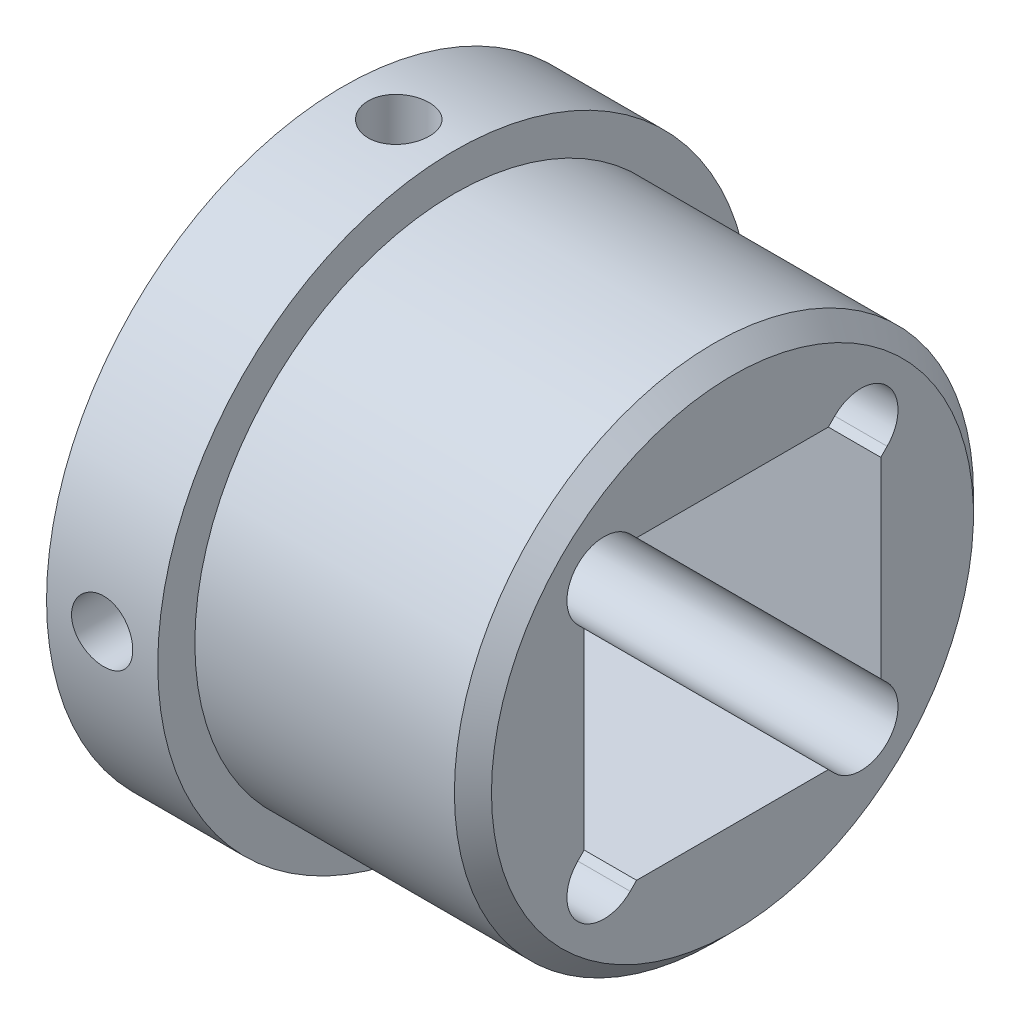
from build123d import *

# Parameters (mm, degrees)
ESQUISSE2_W                  = 16
ESQUISSE2_H                  = 16
ENL_V_MAT_EXTRU_1_DEPTH      = 31.870698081
CHANFREIN1_SIZE              = 1
R_P_TITION_CIRCULAIRE1_COUNT = 4
ENL_V_MAT_EXTRU_2_DEPTH      = 31.870698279
R_P_TITION_CIRCULAIRE2_COUNT = 4


with BuildPart() as part:
    # Esquisse1 → R_volution1 (revolve)
    with BuildSketch(Plane.XY, mode=Mode.PRIVATE) as r_volution1_sk:
        Polygon((0, 0), (21, 0), (21, 14), (6, 14), (6, 16), (0, 16), align=None)
    revolve(r_volution1_sk.sketch.rotate(Axis((-19.097215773, 0, 0), (1, 0, 0)), 90), axis=Axis((-19.097215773, 0, 0), (1, 0, 0)))

    # Esquisse2 → Enl_v. mat.-Extru.1 (cut, through all)
    with BuildSketch(Plane(origin=(21, 0, 0), x_dir=(0, 0, -1), z_dir=(1, 0, 0))):
        Rectangle(ESQUISSE2_W, ESQUISSE2_H)
    extrude(amount=-ENL_V_MAT_EXTRU_1_DEPTH, mode=Mode.SUBTRACT)

    # Chanfrein1
    chanfrein1_edges = [part.edges().sort_by_distance(p)[0] for p in [
        (21, 0, -14),
    ]]
    chamfer(chanfrein1_edges, length=CHANFREIN1_SIZE)

    # Esquisse4 → Trou taraud_ M41 (revolve, cut)
    with BuildSketch(Plane(origin=(3, 8, 0), x_dir=(0, 0, -1), z_dir=(1, 0, 0))):
        Polygon((0, 0), (0, 12.491420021), (1.65, 11.5), (1.65, 0), align=None)
    trou_taraud_m41 = revolve(axis=Axis((3, 1.65, 0), (0, 1, 0)), mode=Mode.SUBTRACT)

    # R_p_tition circulaire1: Trou taraud_ M41 ×4 about axis
    r_p_tition_circulaire1_axis = Axis((-19.097215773, 0, 0), (-1, 0, 0))
    for i in range(1, R_P_TITION_CIRCULAIRE1_COUNT):
        add(trou_taraud_m41.rotate(r_p_tition_circulaire1_axis, i * 360 / R_P_TITION_CIRCULAIRE1_COUNT), mode=Mode.SUBTRACT)

    # Esquisse6 → Enl_v. mat.-Extru.2 (cut, through all)
    with BuildSketch(Plane(origin=(21, 0, 0), x_dir=(0, 0, -1), z_dir=(1, 0, 0))):
        with BuildLine():
            Line((5.515432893, 8.343860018), (5.171572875, 8))
            Line((5.171572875, 8), (8, 5.171572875))
            Line((8, 5.171572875), (8.343860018, 5.515432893))
            ThreePointArc((8.343860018, 5.515432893), (8.343860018, 8.343860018), (5.515432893, 8.343860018))
        make_face()
    enl_v_mat_extru_2 = extrude(amount=-ENL_V_MAT_EXTRU_2_DEPTH, mode=Mode.SUBTRACT)

    # R_p_tition circulaire2: Enl_v. mat.-Extru.2 ×4 about axis
    r_p_tition_circulaire2_axis = Axis((0, 0, 0), (1, 0, 0))
    for i in range(1, R_P_TITION_CIRCULAIRE2_COUNT):
        add(enl_v_mat_extru_2.rotate(r_p_tition_circulaire2_axis, i * 360 / R_P_TITION_CIRCULAIRE2_COUNT), mode=Mode.SUBTRACT)


solid = part.part
